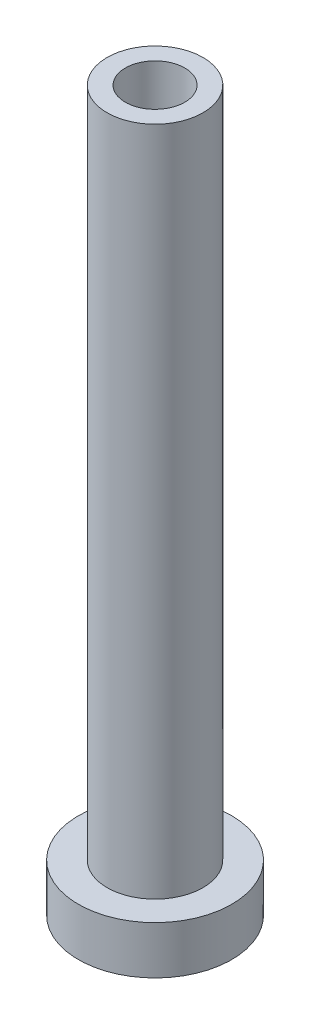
ISO-10303-21;
HEADER;
FILE_DESCRIPTION(('STEP AP214'),'2;1');
FILE_NAME('part.step','',(''),(''),'','','');
FILE_SCHEMA(('AUTOMOTIVE_DESIGN { 1 0 10303 214 1 1 1 1 }'));
ENDSEC;
DATA;
#1=APPLICATION_CONTEXT('core data for automotive mechanical design processes');
#2=APPLICATION_PROTOCOL_DEFINITION('international standard','automotive_design',2000,#1);
#3=PRODUCT_CONTEXT('',#1,'mechanical');
#4=PRODUCT('Part','Part','',(#3));
#5=PRODUCT_RELATED_PRODUCT_CATEGORY('part','',(#4));
#6=PRODUCT_DEFINITION_FORMATION('','',#4);
#7=PRODUCT_DEFINITION_CONTEXT('part definition',#1,'design');
#8=PRODUCT_DEFINITION('design','',#6,#7);
#9=PRODUCT_DEFINITION_SHAPE('','',#8);
#10=(LENGTH_UNIT() NAMED_UNIT(*) SI_UNIT(.MILLI.,.METRE.));
#11=(NAMED_UNIT(*) PLANE_ANGLE_UNIT() SI_UNIT($,.RADIAN.));
#12=(NAMED_UNIT(*) SI_UNIT($,.STERADIAN.) SOLID_ANGLE_UNIT());
#13=UNCERTAINTY_MEASURE_WITH_UNIT(LENGTH_MEASURE(1.E-05),#10,'distance_accuracy_value','');
#14=(GEOMETRIC_REPRESENTATION_CONTEXT(3) GLOBAL_UNCERTAINTY_ASSIGNED_CONTEXT((#13)) GLOBAL_UNIT_ASSIGNED_CONTEXT((#10,
#11,#12)) REPRESENTATION_CONTEXT('',''));
#15=CARTESIAN_POINT('',(0.,0.,0.));
#16=DIRECTION('',(0.,0.,1.));
#17=DIRECTION('',(1.,0.,0.));
#18=AXIS2_PLACEMENT_3D('',#15,#16,#17);
#19=CARTESIAN_POINT('',(0.,0.,0.));
#20=DIRECTION('',(0.,-1.,0.));
#21=DIRECTION('',(0.,0.,-1.));
#22=AXIS2_PLACEMENT_3D('',#19,#20,#21);
#23=CYLINDRICAL_SURFACE('',#22,8.);
#24=CARTESIAN_POINT('',(0.,-5.,0.));
#25=DIRECTION('',(0.,-1.,0.));
#26=DIRECTION('',(0.,0.,-1.));
#27=AXIS2_PLACEMENT_3D('',#24,#25,#26);
#28=CIRCLE('',#27,8.);
#29=CARTESIAN_POINT('',(0.,-5.,-8.));
#30=VERTEX_POINT('',#29);
#31=EDGE_CURVE('E41',#30,#30,#28,.T.);
#32=ORIENTED_EDGE('',*,*,#31,.F.);
#33=EDGE_LOOP('',(#32));
#34=FACE_BOUND('',#33,.T.);
#35=CARTESIAN_POINT('',(0.,0.,0.));
#36=DIRECTION('',(0.,-1.,0.));
#37=DIRECTION('',(0.,0.,-1.));
#38=AXIS2_PLACEMENT_3D('',#35,#36,#37);
#39=CIRCLE('',#38,8.);
#40=CARTESIAN_POINT('',(0.,0.,-8.));
#41=VERTEX_POINT('',#40);
#42=EDGE_CURVE('E8',#41,#41,#39,.T.);
#43=ORIENTED_EDGE('',*,*,#42,.T.);
#44=EDGE_LOOP('',(#43));
#45=FACE_BOUND('',#44,.T.);
#46=ADVANCED_FACE('F13',(#34,#45),#23,.T.);
#47=CARTESIAN_POINT('',(-8.,0.,0.));
#48=DIRECTION('',(0.,-1.,0.));
#49=DIRECTION('',(0.,0.,-1.));
#50=AXIS2_PLACEMENT_3D('',#47,#48,#49);
#51=PLANE('',#50);
#52=ORIENTED_EDGE('',*,*,#42,.F.);
#53=EDGE_LOOP('',(#52));
#54=FACE_BOUND('',#53,.T.);
#55=CARTESIAN_POINT('',(0.,0.,0.));
#56=DIRECTION('',(0.,-1.,0.));
#57=DIRECTION('',(0.,0.,-1.));
#58=AXIS2_PLACEMENT_3D('',#55,#56,#57);
#59=CIRCLE('',#58,5.);
#60=CARTESIAN_POINT('',(0.,0.,-5.));
#61=VERTEX_POINT('',#60);
#62=EDGE_CURVE('E19',#61,#61,#59,.T.);
#63=ORIENTED_EDGE('',*,*,#62,.T.);
#64=EDGE_LOOP('',(#63));
#65=FACE_BOUND('',#64,.T.);
#66=ADVANCED_FACE('F48',(#54,#65),#51,.F.);
#67=CARTESIAN_POINT('',(0.,0.,0.));
#68=DIRECTION('',(0.,-1.,0.));
#69=DIRECTION('',(0.,0.,-1.));
#70=AXIS2_PLACEMENT_3D('',#67,#68,#69);
#71=CYLINDRICAL_SURFACE('',#70,5.);
#72=ORIENTED_EDGE('',*,*,#62,.F.);
#73=EDGE_LOOP('',(#72));
#74=FACE_BOUND('',#73,.T.);
#75=CARTESIAN_POINT('',(0.,70.,0.));
#76=DIRECTION('',(0.,-1.,0.));
#77=DIRECTION('',(0.,0.,-1.));
#78=AXIS2_PLACEMENT_3D('',#75,#76,#77);
#79=CIRCLE('',#78,5.);
#80=CARTESIAN_POINT('',(0.,70.,-5.));
#81=VERTEX_POINT('',#80);
#82=EDGE_CURVE('E23',#81,#81,#79,.T.);
#83=ORIENTED_EDGE('',*,*,#82,.T.);
#84=EDGE_LOOP('',(#83));
#85=FACE_BOUND('',#84,.T.);
#86=ADVANCED_FACE('F54',(#74,#85),#71,.T.);
#87=CARTESIAN_POINT('',(-5.,70.,0.));
#88=DIRECTION('',(0.,-1.,0.));
#89=DIRECTION('',(0.,0.,-1.));
#90=AXIS2_PLACEMENT_3D('',#87,#88,#89);
#91=PLANE('',#90);
#92=ORIENTED_EDGE('',*,*,#82,.F.);
#93=EDGE_LOOP('',(#92));
#94=FACE_BOUND('',#93,.T.);
#95=CARTESIAN_POINT('',(0.,70.,0.));
#96=DIRECTION('',(0.,-1.,0.));
#97=DIRECTION('',(0.,0.,-1.));
#98=AXIS2_PLACEMENT_3D('',#95,#96,#97);
#99=CIRCLE('',#98,3.1);
#100=CARTESIAN_POINT('',(0.,70.,-3.1));
#101=VERTEX_POINT('',#100);
#102=EDGE_CURVE('E27',#101,#101,#99,.T.);
#103=ORIENTED_EDGE('',*,*,#102,.T.);
#104=EDGE_LOOP('',(#103));
#105=FACE_BOUND('',#104,.T.);
#106=ADVANCED_FACE('F60',(#94,#105),#91,.F.);
#107=CARTESIAN_POINT('',(0.,0.,0.));
#108=DIRECTION('',(0.,-1.,0.));
#109=DIRECTION('',(0.,0.,-1.));
#110=AXIS2_PLACEMENT_3D('',#107,#108,#109);
#111=CYLINDRICAL_SURFACE('',#110,3.1);
#112=ORIENTED_EDGE('',*,*,#102,.F.);
#113=EDGE_LOOP('',(#112));
#114=FACE_BOUND('',#113,.T.);
#115=CARTESIAN_POINT('',(0.,25.,0.));
#116=DIRECTION('',(0.,-1.,0.));
#117=DIRECTION('',(0.,0.,-1.));
#118=AXIS2_PLACEMENT_3D('',#115,#116,#117);
#119=CIRCLE('',#118,3.09999999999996);
#120=CARTESIAN_POINT('',(0.,25.,-3.09999999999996));
#121=VERTEX_POINT('',#120);
#122=EDGE_CURVE('E32',#121,#121,#119,.T.);
#123=ORIENTED_EDGE('',*,*,#122,.T.);
#124=EDGE_LOOP('',(#123));
#125=FACE_BOUND('',#124,.T.);
#126=ADVANCED_FACE('F66',(#114,#125),#111,.F.);
#127=CARTESIAN_POINT('',(0.,24.85,0.));
#128=DIRECTION('',(0.,-1.,0.));
#129=DIRECTION('',(0.,0.,-1.));
#130=AXIS2_PLACEMENT_3D('',#127,#128,#129);
#131=CONICAL_SURFACE('',#130,3.25,0.785398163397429);
#132=ORIENTED_EDGE('',*,*,#122,.F.);
#133=EDGE_LOOP('',(#132));
#134=FACE_BOUND('',#133,.T.);
#135=CARTESIAN_POINT('',(0.,24.85,0.));
#136=DIRECTION('',(0.,-1.,0.));
#137=DIRECTION('',(0.,0.,-1.));
#138=AXIS2_PLACEMENT_3D('',#135,#136,#137);
#139=CIRCLE('',#138,3.25);
#140=CARTESIAN_POINT('',(0.,24.85,-3.25));
#141=VERTEX_POINT('',#140);
#142=EDGE_CURVE('E35',#141,#141,#139,.T.);
#143=ORIENTED_EDGE('',*,*,#142,.T.);
#144=EDGE_LOOP('',(#143));
#145=FACE_BOUND('',#144,.T.);
#146=ADVANCED_FACE('F70',(#134,#145),#131,.F.);
#147=CARTESIAN_POINT('',(0.,0.,0.));
#148=DIRECTION('',(0.,-1.,0.));
#149=DIRECTION('',(0.,0.,-1.));
#150=AXIS2_PLACEMENT_3D('',#147,#148,#149);
#151=CYLINDRICAL_SURFACE('',#150,3.25);
#152=ORIENTED_EDGE('',*,*,#142,.F.);
#153=EDGE_LOOP('',(#152));
#154=FACE_BOUND('',#153,.T.);
#155=CARTESIAN_POINT('',(0.,-5.,0.));
#156=DIRECTION('',(0.,-1.,0.));
#157=DIRECTION('',(0.,0.,-1.));
#158=AXIS2_PLACEMENT_3D('',#155,#156,#157);
#159=CIRCLE('',#158,3.25);
#160=CARTESIAN_POINT('',(0.,-5.,-3.25));
#161=VERTEX_POINT('',#160);
#162=EDGE_CURVE('E38',#161,#161,#159,.T.);
#163=ORIENTED_EDGE('',*,*,#162,.T.);
#164=EDGE_LOOP('',(#163));
#165=FACE_BOUND('',#164,.T.);
#166=ADVANCED_FACE('F74',(#154,#165),#151,.F.);
#167=CARTESIAN_POINT('',(-3.25,-5.,0.));
#168=DIRECTION('',(0.,1.,0.));
#169=DIRECTION('',(0.,0.,1.));
#170=AXIS2_PLACEMENT_3D('',#167,#168,#169);
#171=PLANE('',#170);
#172=ORIENTED_EDGE('',*,*,#162,.F.);
#173=EDGE_LOOP('',(#172));
#174=FACE_BOUND('',#173,.T.);
#175=ORIENTED_EDGE('',*,*,#31,.T.);
#176=EDGE_LOOP('',(#175));
#177=FACE_BOUND('',#176,.T.);
#178=ADVANCED_FACE('F45',(#174,#177),#171,.F.);
#179=CLOSED_SHELL('',(#46,#66,#86,#106,#126,#146,#166,#178));
#180=MANIFOLD_SOLID_BREP('B1',#179);
#181=ADVANCED_BREP_SHAPE_REPRESENTATION('',(#18,#180),#14);
#182=SHAPE_DEFINITION_REPRESENTATION(#9,#181);
ENDSEC;
END-ISO-10303-21;
